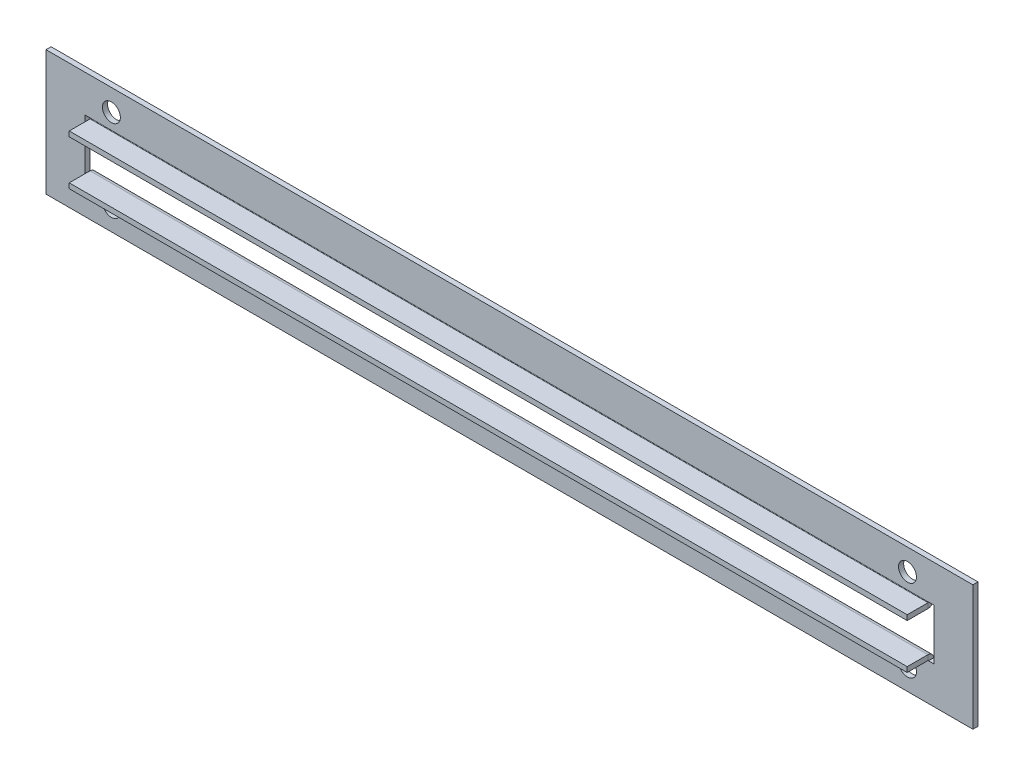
ISO-10303-21;
HEADER;
FILE_DESCRIPTION(('STEP AP214'),'2;1');
FILE_NAME('part.step','',(''),(''),'','','');
FILE_SCHEMA(('AUTOMOTIVE_DESIGN { 1 0 10303 214 1 1 1 1 }'));
ENDSEC;
DATA;
#1=APPLICATION_CONTEXT('core data for automotive mechanical design processes');
#2=APPLICATION_PROTOCOL_DEFINITION('international standard','automotive_design',2000,#1);
#3=PRODUCT_CONTEXT('',#1,'mechanical');
#4=PRODUCT('Part','Part','',(#3));
#5=PRODUCT_RELATED_PRODUCT_CATEGORY('part','',(#4));
#6=PRODUCT_DEFINITION_FORMATION('','',#4);
#7=PRODUCT_DEFINITION_CONTEXT('part definition',#1,'design');
#8=PRODUCT_DEFINITION('design','',#6,#7);
#9=PRODUCT_DEFINITION_SHAPE('','',#8);
#10=(LENGTH_UNIT() NAMED_UNIT(*) SI_UNIT(.MILLI.,.METRE.));
#11=(NAMED_UNIT(*) PLANE_ANGLE_UNIT() SI_UNIT($,.RADIAN.));
#12=(NAMED_UNIT(*) SI_UNIT($,.STERADIAN.) SOLID_ANGLE_UNIT());
#13=UNCERTAINTY_MEASURE_WITH_UNIT(LENGTH_MEASURE(1.E-05),#10,'distance_accuracy_value','');
#14=(GEOMETRIC_REPRESENTATION_CONTEXT(3) GLOBAL_UNCERTAINTY_ASSIGNED_CONTEXT((#13)) GLOBAL_UNIT_ASSIGNED_CONTEXT((#10,
#11,#12)) REPRESENTATION_CONTEXT('',''));
#15=CARTESIAN_POINT('',(0.,0.,0.));
#16=DIRECTION('',(0.,0.,1.));
#17=DIRECTION('',(1.,0.,0.));
#18=AXIS2_PLACEMENT_3D('',#15,#16,#17);
#19=CARTESIAN_POINT('',(0.,0.,2.27838));
#20=DIRECTION('',(0.,0.,-1.));
#21=DIRECTION('',(-1.,0.,0.));
#22=AXIS2_PLACEMENT_3D('',#19,#20,#21);
#23=PLANE('',#22);
#24=CARTESIAN_POINT('',(-177.8,-48.6613547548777,2.27838));
#25=DIRECTION('',(0.,0.,1.));
#26=DIRECTION('',(1.,0.,0.));
#27=AXIS2_PLACEMENT_3D('',#24,#25,#26);
#28=CIRCLE('',#27,4.00050000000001);
#29=CARTESIAN_POINT('',(-173.7995,-48.6613547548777,2.27838));
#30=VERTEX_POINT('',#29);
#31=EDGE_CURVE('E335',#30,#30,#28,.T.);
#32=ORIENTED_EDGE('',*,*,#31,.F.);
#33=EDGE_LOOP('',(#32));
#34=FACE_BOUND('',#33,.T.);
#35=CARTESIAN_POINT('',(177.8,-11.9837547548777,2.27838));
#36=DIRECTION('',(0.,0.,1.));
#37=DIRECTION('',(1.,0.,0.));
#38=AXIS2_PLACEMENT_3D('',#35,#36,#37);
#39=CIRCLE('',#38,4.00050000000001);
#40=CARTESIAN_POINT('',(181.8005,-11.9837547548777,2.27838));
#41=VERTEX_POINT('',#40);
#42=EDGE_CURVE('E328',#41,#41,#39,.T.);
#43=ORIENTED_EDGE('',*,*,#42,.F.);
#44=EDGE_LOOP('',(#43));
#45=FACE_BOUND('',#44,.T.);
#46=CARTESIAN_POINT('',(177.8,-48.6613547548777,2.27838));
#47=DIRECTION('',(0.,0.,1.));
#48=DIRECTION('',(1.,0.,0.));
#49=AXIS2_PLACEMENT_3D('',#46,#47,#48);
#50=CIRCLE('',#49,4.00049999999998);
#51=CARTESIAN_POINT('',(181.8005,-48.6613547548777,2.27838));
#52=VERTEX_POINT('',#51);
#53=EDGE_CURVE('E322',#52,#52,#50,.T.);
#54=ORIENTED_EDGE('',*,*,#53,.F.);
#55=EDGE_LOOP('',(#54));
#56=FACE_BOUND('',#55,.T.);
#57=CARTESIAN_POINT('',(-177.8,-11.9837547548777,2.27838));
#58=DIRECTION('',(0.,0.,1.));
#59=DIRECTION('',(1.,0.,0.));
#60=AXIS2_PLACEMENT_3D('',#57,#58,#59);
#61=CIRCLE('',#60,4.00050000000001);
#62=CARTESIAN_POINT('',(-173.7995,-11.9837547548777,2.27838));
#63=VERTEX_POINT('',#62);
#64=EDGE_CURVE('E334',#63,#63,#61,.T.);
#65=ORIENTED_EDGE('',*,*,#64,.F.);
#66=EDGE_LOOP('',(#65));
#67=FACE_BOUND('',#66,.T.);
#68=DIRECTION('',(0.,-1.,0.));
#69=VECTOR('',#68,1.);
#70=CARTESIAN_POINT('',(-207.01,-58.2625547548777,2.27838));
#71=LINE('',#70,#69);
#72=CARTESIAN_POINT('',(-207.01,-2.38255475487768,2.27838));
#73=VERTEX_POINT('',#72);
#74=CARTESIAN_POINT('',(-207.01,-58.2625547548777,2.27838));
#75=VERTEX_POINT('',#74);
#76=EDGE_CURVE('E349',#73,#75,#71,.T.);
#77=ORIENTED_EDGE('',*,*,#76,.T.);
#78=DIRECTION('',(1.,0.,0.));
#79=VECTOR('',#78,1.);
#80=CARTESIAN_POINT('',(-207.01,-58.2625547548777,2.27838));
#81=LINE('',#80,#79);
#82=CARTESIAN_POINT('',(207.01,-58.2625547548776,2.27838));
#83=VERTEX_POINT('',#82);
#84=EDGE_CURVE('E352',#75,#83,#81,.T.);
#85=ORIENTED_EDGE('',*,*,#84,.T.);
#86=DIRECTION('',(0.,1.,0.));
#87=VECTOR('',#86,1.);
#88=CARTESIAN_POINT('',(207.01,-58.2625547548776,2.27838));
#89=LINE('',#88,#87);
#90=CARTESIAN_POINT('',(207.01,-2.38255475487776,2.27838));
#91=VERTEX_POINT('',#90);
#92=EDGE_CURVE('E355',#83,#91,#89,.T.);
#93=ORIENTED_EDGE('',*,*,#92,.T.);
#94=DIRECTION('',(-1.,0.,0.));
#95=VECTOR('',#94,1.);
#96=CARTESIAN_POINT('',(-207.01,-2.38255475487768,2.27838));
#97=LINE('',#96,#95);
#98=EDGE_CURVE('E357',#91,#73,#97,.T.);
#99=ORIENTED_EDGE('',*,*,#98,.T.);
#100=EDGE_LOOP('',(#77,#85,#93,#99));
#101=FACE_BOUND('',#100,.T.);
#102=DIRECTION('',(1.,0.,0.));
#103=VECTOR('',#102,1.);
#104=CARTESIAN_POINT('',(-189.6872,-41.7017547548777,2.27837999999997));
#105=LINE('',#104,#103);
#106=CARTESIAN_POINT('',(-189.6872,-41.7017547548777,2.27837999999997));
#107=VERTEX_POINT('',#106);
#108=CARTESIAN_POINT('',(-187.1472,-41.7017547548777,2.27837999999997));
#109=VERTEX_POINT('',#108);
#110=EDGE_CURVE('E296',#107,#109,#105,.T.);
#111=ORIENTED_EDGE('',*,*,#110,.F.);
#112=DIRECTION('',(0.,-1.,0.));
#113=VECTOR('',#112,1.);
#114=CARTESIAN_POINT('',(-189.6872,-41.4985547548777,2.27838));
#115=LINE('',#114,#113);
#116=CARTESIAN_POINT('',(-189.6872,-18.9433547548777,2.27838));
#117=VERTEX_POINT('',#116);
#118=EDGE_CURVE('E62',#117,#107,#115,.T.);
#119=ORIENTED_EDGE('',*,*,#118,.F.);
#120=DIRECTION('',(-1.,0.,0.));
#121=VECTOR('',#120,1.);
#122=CARTESIAN_POINT('',(-187.1472,-18.9433547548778,2.27838000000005));
#123=LINE('',#122,#121);
#124=CARTESIAN_POINT('',(-187.1472,-18.9433547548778,2.27838000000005));
#125=VERTEX_POINT('',#124);
#126=EDGE_CURVE('E312',#125,#117,#123,.T.);
#127=ORIENTED_EDGE('',*,*,#126,.F.);
#128=DIRECTION('',(1.,0.,0.));
#129=VECTOR('',#128,1.);
#130=CARTESIAN_POINT('',(187.1472,-18.9433547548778,2.27838000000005));
#131=LINE('',#130,#129);
#132=CARTESIAN_POINT('',(187.1472,-18.9433547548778,2.27838000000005));
#133=VERTEX_POINT('',#132);
#134=EDGE_CURVE('E286',#133,#125,#131,.F.);
#135=ORIENTED_EDGE('',*,*,#134,.F.);
#136=DIRECTION('',(-1.,0.,0.));
#137=VECTOR('',#136,1.);
#138=CARTESIAN_POINT('',(189.6872,-18.9433547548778,2.27838000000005));
#139=LINE('',#138,#137);
#140=CARTESIAN_POINT('',(189.6872,-18.9433547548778,2.27838));
#141=VERTEX_POINT('',#140);
#142=EDGE_CURVE('E308',#141,#133,#139,.T.);
#143=ORIENTED_EDGE('',*,*,#142,.F.);
#144=DIRECTION('',(0.,1.,0.));
#145=VECTOR('',#144,1.);
#146=CARTESIAN_POINT('',(189.6872,-41.4985547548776,2.27838));
#147=LINE('',#146,#145);
#148=CARTESIAN_POINT('',(189.6872,-41.7017547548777,2.27837999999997));
#149=VERTEX_POINT('',#148);
#150=EDGE_CURVE('E54',#149,#141,#147,.T.);
#151=ORIENTED_EDGE('',*,*,#150,.F.);
#152=DIRECTION('',(1.,0.,0.));
#153=VECTOR('',#152,1.);
#154=CARTESIAN_POINT('',(187.1472,-41.7017547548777,2.27837999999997));
#155=LINE('',#154,#153);
#156=CARTESIAN_POINT('',(187.1472,-41.7017547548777,2.27837999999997));
#157=VERTEX_POINT('',#156);
#158=EDGE_CURVE('E301',#157,#149,#155,.T.);
#159=ORIENTED_EDGE('',*,*,#158,.F.);
#160=DIRECTION('',(-1.,0.,0.));
#161=VECTOR('',#160,1.);
#162=CARTESIAN_POINT('',(-187.1472,-41.7017547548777,2.27837999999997));
#163=LINE('',#162,#161);
#164=EDGE_CURVE('E235',#109,#157,#163,.F.);
#165=ORIENTED_EDGE('',*,*,#164,.F.);
#166=EDGE_LOOP('',(#111,#119,#127,#135,#143,#151,#159,#165));
#167=FACE_BOUND('',#166,.T.);
#168=ADVANCED_FACE('F39',(#34,#45,#56,#67,#101,#167),#23,.F.);
#169=CARTESIAN_POINT('',(0.,0.,0.));
#170=DIRECTION('',(0.,0.,-1.));
#171=DIRECTION('',(-1.,0.,0.));
#172=AXIS2_PLACEMENT_3D('',#169,#170,#171);
#173=PLANE('',#172);
#174=CARTESIAN_POINT('',(-177.8,-48.6613547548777,0.));
#175=DIRECTION('',(0.,0.,1.));
#176=DIRECTION('',(1.,0.,0.));
#177=AXIS2_PLACEMENT_3D('',#174,#175,#176);
#178=CIRCLE('',#177,4.00050000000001);
#179=CARTESIAN_POINT('',(-173.7995,-48.6613547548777,0.));
#180=VERTEX_POINT('',#179);
#181=EDGE_CURVE('E331',#180,#180,#178,.T.);
#182=ORIENTED_EDGE('',*,*,#181,.T.);
#183=EDGE_LOOP('',(#182));
#184=FACE_BOUND('',#183,.T.);
#185=CARTESIAN_POINT('',(177.8,-11.9837547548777,0.));
#186=DIRECTION('',(0.,0.,1.));
#187=DIRECTION('',(1.,0.,0.));
#188=AXIS2_PLACEMENT_3D('',#185,#186,#187);
#189=CIRCLE('',#188,4.00050000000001);
#190=CARTESIAN_POINT('',(181.8005,-11.9837547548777,0.));
#191=VERTEX_POINT('',#190);
#192=EDGE_CURVE('E338',#191,#191,#189,.T.);
#193=ORIENTED_EDGE('',*,*,#192,.T.);
#194=EDGE_LOOP('',(#193));
#195=FACE_BOUND('',#194,.T.);
#196=CARTESIAN_POINT('',(177.8,-48.6613547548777,0.));
#197=DIRECTION('',(0.,0.,1.));
#198=DIRECTION('',(1.,0.,0.));
#199=AXIS2_PLACEMENT_3D('',#196,#197,#198);
#200=CIRCLE('',#199,4.00049999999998);
#201=CARTESIAN_POINT('',(181.8005,-48.6613547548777,0.));
#202=VERTEX_POINT('',#201);
#203=EDGE_CURVE('E325',#202,#202,#200,.T.);
#204=ORIENTED_EDGE('',*,*,#203,.T.);
#205=EDGE_LOOP('',(#204));
#206=FACE_BOUND('',#205,.T.);
#207=CARTESIAN_POINT('',(-177.8,-11.9837547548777,0.));
#208=DIRECTION('',(0.,0.,1.));
#209=DIRECTION('',(1.,0.,0.));
#210=AXIS2_PLACEMENT_3D('',#207,#208,#209);
#211=CIRCLE('',#210,4.00050000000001);
#212=CARTESIAN_POINT('',(-173.7995,-11.9837547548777,0.));
#213=VERTEX_POINT('',#212);
#214=EDGE_CURVE('E343',#213,#213,#211,.T.);
#215=ORIENTED_EDGE('',*,*,#214,.T.);
#216=EDGE_LOOP('',(#215));
#217=FACE_BOUND('',#216,.T.);
#218=DIRECTION('',(0.,-1.,0.));
#219=VECTOR('',#218,1.);
#220=CARTESIAN_POINT('',(-207.01,-58.2625547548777,0.));
#221=LINE('',#220,#219);
#222=CARTESIAN_POINT('',(-207.01,-2.38255475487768,0.));
#223=VERTEX_POINT('',#222);
#224=CARTESIAN_POINT('',(-207.01,-58.2625547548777,0.));
#225=VERTEX_POINT('',#224);
#226=EDGE_CURVE('E346',#223,#225,#221,.T.);
#227=ORIENTED_EDGE('',*,*,#226,.F.);
#228=DIRECTION('',(-1.,0.,0.));
#229=VECTOR('',#228,1.);
#230=CARTESIAN_POINT('',(-207.01,-2.38255475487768,0.));
#231=LINE('',#230,#229);
#232=CARTESIAN_POINT('',(207.01,-2.38255475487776,0.));
#233=VERTEX_POINT('',#232);
#234=EDGE_CURVE('E353',#233,#223,#231,.T.);
#235=ORIENTED_EDGE('',*,*,#234,.F.);
#236=DIRECTION('',(0.,1.,0.));
#237=VECTOR('',#236,1.);
#238=CARTESIAN_POINT('',(207.01,-58.2625547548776,0.));
#239=LINE('',#238,#237);
#240=CARTESIAN_POINT('',(207.01,-58.2625547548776,0.));
#241=VERTEX_POINT('',#240);
#242=EDGE_CURVE('E364',#241,#233,#239,.T.);
#243=ORIENTED_EDGE('',*,*,#242,.F.);
#244=DIRECTION('',(1.,0.,0.));
#245=VECTOR('',#244,1.);
#246=CARTESIAN_POINT('',(-207.01,-58.2625547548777,0.));
#247=LINE('',#246,#245);
#248=EDGE_CURVE('E362',#225,#241,#247,.T.);
#249=ORIENTED_EDGE('',*,*,#248,.F.);
#250=EDGE_LOOP('',(#227,#235,#243,#249));
#251=FACE_BOUND('',#250,.T.);
#252=DIRECTION('',(0.,-1.,0.));
#253=VECTOR('',#252,1.);
#254=CARTESIAN_POINT('',(-189.6872,-41.4985547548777,0.));
#255=LINE('',#254,#253);
#256=CARTESIAN_POINT('',(-189.6872,-18.9433547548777,0.));
#257=VERTEX_POINT('',#256);
#258=CARTESIAN_POINT('',(-189.6872,-41.7017547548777,0.));
#259=VERTEX_POINT('',#258);
#260=EDGE_CURVE('E318',#257,#259,#255,.T.);
#261=ORIENTED_EDGE('',*,*,#260,.T.);
#262=DIRECTION('',(1.,0.,0.));
#263=VECTOR('',#262,1.);
#264=CARTESIAN_POINT('',(0.,-41.7017547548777,0.));
#265=LINE('',#264,#263);
#266=CARTESIAN_POINT('',(-187.1472,-41.7017547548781,0.));
#267=VERTEX_POINT('',#266);
#268=EDGE_CURVE('E11',#259,#267,#265,.T.);
#269=ORIENTED_EDGE('',*,*,#268,.T.);
#270=DIRECTION('',(-1.,0.,0.));
#271=VECTOR('',#270,1.);
#272=CARTESIAN_POINT('',(-187.1472,-41.7017547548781,0.));
#273=LINE('',#272,#271);
#274=CARTESIAN_POINT('',(187.1472,-41.7017547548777,0.));
#275=VERTEX_POINT('',#274);
#276=EDGE_CURVE('E184',#267,#275,#273,.F.);
#277=ORIENTED_EDGE('',*,*,#276,.T.);
#278=DIRECTION('',(1.,0.,0.));
#279=VECTOR('',#278,1.);
#280=CARTESIAN_POINT('',(0.,-41.7017547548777,0.));
#281=LINE('',#280,#279);
#282=CARTESIAN_POINT('',(189.6872,-41.7017547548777,0.));
#283=VERTEX_POINT('',#282);
#284=EDGE_CURVE('E47',#275,#283,#281,.T.);
#285=ORIENTED_EDGE('',*,*,#284,.T.);
#286=DIRECTION('',(0.,1.,0.));
#287=VECTOR('',#286,1.);
#288=CARTESIAN_POINT('',(189.6872,-41.4985547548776,0.));
#289=LINE('',#288,#287);
#290=CARTESIAN_POINT('',(189.6872,-18.9433547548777,0.));
#291=VERTEX_POINT('',#290);
#292=EDGE_CURVE('E320',#283,#291,#289,.T.);
#293=ORIENTED_EDGE('',*,*,#292,.T.);
#294=DIRECTION('',(-1.,0.,0.));
#295=VECTOR('',#294,1.);
#296=CARTESIAN_POINT('',(0.,-18.9433547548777,0.));
#297=LINE('',#296,#295);
#298=CARTESIAN_POINT('',(187.1472,-18.9433547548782,0.));
#299=VERTEX_POINT('',#298);
#300=EDGE_CURVE('E381',#291,#299,#297,.T.);
#301=ORIENTED_EDGE('',*,*,#300,.T.);
#302=DIRECTION('',(1.,0.,0.));
#303=VECTOR('',#302,1.);
#304=CARTESIAN_POINT('',(187.1472,-18.9433547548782,0.));
#305=LINE('',#304,#303);
#306=CARTESIAN_POINT('',(-187.1472,-18.9433547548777,0.));
#307=VERTEX_POINT('',#306);
#308=EDGE_CURVE('E273',#299,#307,#305,.F.);
#309=ORIENTED_EDGE('',*,*,#308,.T.);
#310=DIRECTION('',(-1.,0.,0.));
#311=VECTOR('',#310,1.);
#312=CARTESIAN_POINT('',(0.,-18.9433547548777,0.));
#313=LINE('',#312,#311);
#314=EDGE_CURVE('E378',#307,#257,#313,.T.);
#315=ORIENTED_EDGE('',*,*,#314,.T.);
#316=EDGE_LOOP('',(#261,#269,#277,#285,#293,#301,#309,#315));
#317=FACE_BOUND('',#316,.T.);
#318=ADVANCED_FACE('F386',(#184,#195,#206,#217,#251,#317),#173,.T.);
#319=CARTESIAN_POINT('',(-207.01,-58.2625547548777,2.27838));
#320=DIRECTION('',(1.,0.,0.));
#321=DIRECTION('',(0.,0.,-1.));
#322=AXIS2_PLACEMENT_3D('',#319,#320,#321);
#323=PLANE('',#322);
#324=ORIENTED_EDGE('',*,*,#226,.T.);
#325=DIRECTION('',(0.,0.,-1.));
#326=VECTOR('',#325,1.);
#327=CARTESIAN_POINT('',(-207.01,-58.2625547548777,2.27838));
#328=LINE('',#327,#326);
#329=EDGE_CURVE('E375',#75,#225,#328,.T.);
#330=ORIENTED_EDGE('',*,*,#329,.F.);
#331=ORIENTED_EDGE('',*,*,#76,.F.);
#332=DIRECTION('',(0.,0.,-1.));
#333=VECTOR('',#332,1.);
#334=CARTESIAN_POINT('',(-207.01,-2.38255475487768,2.27838));
#335=LINE('',#334,#333);
#336=EDGE_CURVE('E359',#73,#223,#335,.T.);
#337=ORIENTED_EDGE('',*,*,#336,.T.);
#338=EDGE_LOOP('',(#324,#330,#331,#337));
#339=FACE_BOUND('',#338,.T.);
#340=ADVANCED_FACE('F41',(#339),#323,.F.);
#341=CARTESIAN_POINT('',(-207.01,-58.2625547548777,2.27838));
#342=DIRECTION('',(0.,1.,0.));
#343=DIRECTION('',(-1.,0.,0.));
#344=AXIS2_PLACEMENT_3D('',#341,#342,#343);
#345=PLANE('',#344);
#346=ORIENTED_EDGE('',*,*,#248,.T.);
#347=DIRECTION('',(0.,0.,-1.));
#348=VECTOR('',#347,1.);
#349=CARTESIAN_POINT('',(207.01,-58.2625547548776,2.27838));
#350=LINE('',#349,#348);
#351=EDGE_CURVE('E372',#83,#241,#350,.T.);
#352=ORIENTED_EDGE('',*,*,#351,.F.);
#353=ORIENTED_EDGE('',*,*,#84,.F.);
#354=ORIENTED_EDGE('',*,*,#329,.T.);
#355=EDGE_LOOP('',(#346,#352,#353,#354));
#356=FACE_BOUND('',#355,.T.);
#357=ADVANCED_FACE('F453',(#356),#345,.F.);
#358=CARTESIAN_POINT('',(207.01,-58.2625547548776,2.27838));
#359=DIRECTION('',(-1.,0.,0.));
#360=DIRECTION('',(0.,0.,1.));
#361=AXIS2_PLACEMENT_3D('',#358,#359,#360);
#362=PLANE('',#361);
#363=ORIENTED_EDGE('',*,*,#242,.T.);
#364=DIRECTION('',(0.,0.,-1.));
#365=VECTOR('',#364,1.);
#366=CARTESIAN_POINT('',(207.01,-2.38255475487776,2.27838));
#367=LINE('',#366,#365);
#368=EDGE_CURVE('E369',#91,#233,#367,.T.);
#369=ORIENTED_EDGE('',*,*,#368,.F.);
#370=ORIENTED_EDGE('',*,*,#92,.F.);
#371=ORIENTED_EDGE('',*,*,#351,.T.);
#372=EDGE_LOOP('',(#363,#369,#370,#371));
#373=FACE_BOUND('',#372,.T.);
#374=ADVANCED_FACE('F450',(#373),#362,.F.);
#375=CARTESIAN_POINT('',(-207.01,-2.38255475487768,2.27838));
#376=DIRECTION('',(0.,-1.,0.));
#377=DIRECTION('',(1.,0.,0.));
#378=AXIS2_PLACEMENT_3D('',#375,#376,#377);
#379=PLANE('',#378);
#380=ORIENTED_EDGE('',*,*,#234,.T.);
#381=ORIENTED_EDGE('',*,*,#336,.F.);
#382=ORIENTED_EDGE('',*,*,#98,.F.);
#383=ORIENTED_EDGE('',*,*,#368,.T.);
#384=EDGE_LOOP('',(#380,#381,#382,#383));
#385=FACE_BOUND('',#384,.T.);
#386=ADVANCED_FACE('F447',(#385),#379,.F.);
#387=CARTESIAN_POINT('',(-177.8,-11.9837547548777,0.));
#388=DIRECTION('',(0.,0.,1.));
#389=DIRECTION('',(1.,0.,0.));
#390=AXIS2_PLACEMENT_3D('',#387,#388,#389);
#391=CYLINDRICAL_SURFACE('',#390,4.00050000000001);
#392=ORIENTED_EDGE('',*,*,#214,.F.);
#393=EDGE_LOOP('',(#392));
#394=FACE_BOUND('',#393,.T.);
#395=ORIENTED_EDGE('',*,*,#64,.T.);
#396=EDGE_LOOP('',(#395));
#397=FACE_BOUND('',#396,.T.);
#398=ADVANCED_FACE('F444',(#394,#397),#391,.F.);
#399=CARTESIAN_POINT('',(177.8,-48.6613547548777,0.));
#400=DIRECTION('',(0.,0.,1.));
#401=DIRECTION('',(1.,0.,0.));
#402=AXIS2_PLACEMENT_3D('',#399,#400,#401);
#403=CYLINDRICAL_SURFACE('',#402,4.00049999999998);
#404=ORIENTED_EDGE('',*,*,#203,.F.);
#405=EDGE_LOOP('',(#404));
#406=FACE_BOUND('',#405,.T.);
#407=ORIENTED_EDGE('',*,*,#53,.T.);
#408=EDGE_LOOP('',(#407));
#409=FACE_BOUND('',#408,.T.);
#410=ADVANCED_FACE('F529',(#406,#409),#403,.F.);
#411=CARTESIAN_POINT('',(177.8,-11.9837547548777,0.));
#412=DIRECTION('',(0.,0.,1.));
#413=DIRECTION('',(1.,0.,0.));
#414=AXIS2_PLACEMENT_3D('',#411,#412,#413);
#415=CYLINDRICAL_SURFACE('',#414,4.00050000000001);
#416=ORIENTED_EDGE('',*,*,#192,.F.);
#417=EDGE_LOOP('',(#416));
#418=FACE_BOUND('',#417,.T.);
#419=ORIENTED_EDGE('',*,*,#42,.T.);
#420=EDGE_LOOP('',(#419));
#421=FACE_BOUND('',#420,.T.);
#422=ADVANCED_FACE('F532',(#418,#421),#415,.F.);
#423=CARTESIAN_POINT('',(-177.8,-48.6613547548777,0.));
#424=DIRECTION('',(0.,0.,1.));
#425=DIRECTION('',(1.,0.,0.));
#426=AXIS2_PLACEMENT_3D('',#423,#424,#425);
#427=CYLINDRICAL_SURFACE('',#426,4.00050000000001);
#428=ORIENTED_EDGE('',*,*,#181,.F.);
#429=EDGE_LOOP('',(#428));
#430=FACE_BOUND('',#429,.T.);
#431=ORIENTED_EDGE('',*,*,#31,.T.);
#432=EDGE_LOOP('',(#431));
#433=FACE_BOUND('',#432,.T.);
#434=ADVANCED_FACE('F528',(#430,#433),#427,.F.);
#435=CARTESIAN_POINT('',(-189.6872,-41.4985547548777,0.));
#436=DIRECTION('',(-1.,0.,0.));
#437=DIRECTION('',(0.,0.,1.));
#438=AXIS2_PLACEMENT_3D('',#435,#436,#437);
#439=PLANE('',#438);
#440=ORIENTED_EDGE('',*,*,#118,.T.);
#441=DIRECTION('',(0.,0.,-1.));
#442=VECTOR('',#441,1.);
#443=CARTESIAN_POINT('',(-189.6872,-41.7017547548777,2.27837999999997));
#444=LINE('',#443,#442);
#445=EDGE_CURVE('E300',#107,#259,#444,.T.);
#446=ORIENTED_EDGE('',*,*,#445,.T.);
#447=ORIENTED_EDGE('',*,*,#260,.F.);
#448=DIRECTION('',(0.,0.,-1.));
#449=VECTOR('',#448,1.);
#450=CARTESIAN_POINT('',(-189.6872,-18.9433547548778,2.27838000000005));
#451=LINE('',#450,#449);
#452=EDGE_CURVE('E299',#117,#257,#451,.T.);
#453=ORIENTED_EDGE('',*,*,#452,.F.);
#454=EDGE_LOOP('',(#440,#446,#447,#453));
#455=FACE_BOUND('',#454,.T.);
#456=ADVANCED_FACE('F402',(#455),#439,.F.);
#457=CARTESIAN_POINT('',(189.6872,-41.4985547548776,0.));
#458=DIRECTION('',(1.,0.,0.));
#459=DIRECTION('',(0.,0.,-1.));
#460=AXIS2_PLACEMENT_3D('',#457,#458,#459);
#461=PLANE('',#460);
#462=ORIENTED_EDGE('',*,*,#150,.T.);
#463=DIRECTION('',(0.,0.,-1.));
#464=VECTOR('',#463,1.);
#465=CARTESIAN_POINT('',(189.6872,-18.9433547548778,2.27838000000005));
#466=LINE('',#465,#464);
#467=EDGE_CURVE('E311',#141,#291,#466,.T.);
#468=ORIENTED_EDGE('',*,*,#467,.T.);
#469=ORIENTED_EDGE('',*,*,#292,.F.);
#470=DIRECTION('',(0.,0.,-1.));
#471=VECTOR('',#470,1.);
#472=CARTESIAN_POINT('',(189.6872,-41.7017547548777,2.27837999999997));
#473=LINE('',#472,#471);
#474=EDGE_CURVE('E293',#149,#283,#473,.T.);
#475=ORIENTED_EDGE('',*,*,#474,.F.);
#476=EDGE_LOOP('',(#462,#468,#469,#475));
#477=FACE_BOUND('',#476,.T.);
#478=ADVANCED_FACE('F392',(#477),#461,.F.);
#479=CARTESIAN_POINT('',(189.6872,-18.9433547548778,2.27838000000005));
#480=DIRECTION('',(0.,-1.,0.));
#481=DIRECTION('',(0.,0.,-1.));
#482=AXIS2_PLACEMENT_3D('',#479,#480,#481);
#483=PLANE('',#482);
#484=ORIENTED_EDGE('',*,*,#300,.F.);
#485=ORIENTED_EDGE('',*,*,#467,.F.);
#486=ORIENTED_EDGE('',*,*,#142,.T.);
#487=DIRECTION('',(0.,-1.87814549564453E-13,-1.));
#488=VECTOR('',#487,1.);
#489=CARTESIAN_POINT('',(187.1472,-18.9433547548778,2.27838000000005));
#490=LINE('',#489,#488);
#491=EDGE_CURVE('E280',#133,#299,#490,.T.);
#492=ORIENTED_EDGE('',*,*,#491,.T.);
#493=EDGE_LOOP('',(#484,#485,#486,#492));
#494=FACE_BOUND('',#493,.T.);
#495=ADVANCED_FACE('F395',(#494),#483,.T.);
#496=CARTESIAN_POINT('',(-187.1472,-18.9433547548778,2.27838000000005));
#497=DIRECTION('',(0.,-1.,0.));
#498=DIRECTION('',(0.,0.,-1.));
#499=AXIS2_PLACEMENT_3D('',#496,#497,#498);
#500=PLANE('',#499);
#501=ORIENTED_EDGE('',*,*,#314,.F.);
#502=DIRECTION('',(0.,-1.87814549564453E-13,-1.));
#503=VECTOR('',#502,1.);
#504=CARTESIAN_POINT('',(-187.1472,-18.9433547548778,2.27838000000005));
#505=LINE('',#504,#503);
#506=EDGE_CURVE('E290',#125,#307,#505,.T.);
#507=ORIENTED_EDGE('',*,*,#506,.F.);
#508=ORIENTED_EDGE('',*,*,#126,.T.);
#509=ORIENTED_EDGE('',*,*,#452,.T.);
#510=EDGE_LOOP('',(#501,#507,#508,#509));
#511=FACE_BOUND('',#510,.T.);
#512=ADVANCED_FACE('F400',(#511),#500,.T.);
#513=CARTESIAN_POINT('',(-189.6872,-41.7017547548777,2.27837999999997));
#514=DIRECTION('',(0.,1.,0.));
#515=DIRECTION('',(0.,0.,1.));
#516=AXIS2_PLACEMENT_3D('',#513,#514,#515);
#517=PLANE('',#516);
#518=ORIENTED_EDGE('',*,*,#268,.F.);
#519=ORIENTED_EDGE('',*,*,#445,.F.);
#520=ORIENTED_EDGE('',*,*,#110,.T.);
#521=DIRECTION('',(0.,-1.70740499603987E-13,-1.));
#522=VECTOR('',#521,1.);
#523=CARTESIAN_POINT('',(-187.1472,-41.7017547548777,2.27837999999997));
#524=LINE('',#523,#522);
#525=EDGE_CURVE('E231',#109,#267,#524,.T.);
#526=ORIENTED_EDGE('',*,*,#525,.T.);
#527=EDGE_LOOP('',(#518,#519,#520,#526));
#528=FACE_BOUND('',#527,.T.);
#529=ADVANCED_FACE('F406',(#528),#517,.T.);
#530=CARTESIAN_POINT('',(187.1472,-41.7017547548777,2.27837999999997));
#531=DIRECTION('',(0.,1.,0.));
#532=DIRECTION('',(0.,0.,1.));
#533=AXIS2_PLACEMENT_3D('',#530,#531,#532);
#534=PLANE('',#533);
#535=ORIENTED_EDGE('',*,*,#284,.F.);
#536=DIRECTION('',(0.,-1.70740499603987E-13,-1.));
#537=VECTOR('',#536,1.);
#538=CARTESIAN_POINT('',(187.1472,-41.7017547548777,2.27837999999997));
#539=LINE('',#538,#537);
#540=EDGE_CURVE('E238',#157,#275,#539,.T.);
#541=ORIENTED_EDGE('',*,*,#540,.F.);
#542=ORIENTED_EDGE('',*,*,#158,.T.);
#543=ORIENTED_EDGE('',*,*,#474,.T.);
#544=EDGE_LOOP('',(#535,#541,#542,#543));
#545=FACE_BOUND('',#544,.T.);
#546=ADVANCED_FACE('F390',(#545),#534,.T.);
#547=CARTESIAN_POINT('',(-187.1472,-18.9433547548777,2.48158000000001));
#548=DIRECTION('',(-1.,0.,0.));
#549=DIRECTION('',(0.,0.,1.));
#550=AXIS2_PLACEMENT_3D('',#547,#548,#549);
#551=PLANE('',#550);
#552=DIRECTION('',(0.,-1.,0.));
#553=VECTOR('',#552,1.);
#554=CARTESIAN_POINT('',(-187.1472,-19.1465547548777,2.48158));
#555=LINE('',#554,#553);
#556=CARTESIAN_POINT('',(-187.1472,-19.1465547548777,2.48158000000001));
#557=VERTEX_POINT('',#556);
#558=CARTESIAN_POINT('',(-187.1472,-21.4249347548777,2.48158));
#559=VERTEX_POINT('',#558);
#560=EDGE_CURVE('E241',#557,#559,#555,.T.);
#561=ORIENTED_EDGE('',*,*,#560,.F.);
#562=CARTESIAN_POINT('',(-187.1472,-18.9433547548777,2.48158000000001));
#563=DIRECTION('',(1.,0.,0.));
#564=DIRECTION('',(0.,0.,-1.));
#565=AXIS2_PLACEMENT_3D('',#562,#563,#564);
#566=CIRCLE('',#565,0.203199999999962);
#567=EDGE_CURVE('E283',#125,#557,#566,.F.);
#568=ORIENTED_EDGE('',*,*,#567,.F.);
#569=ORIENTED_EDGE('',*,*,#506,.T.);
#570=CARTESIAN_POINT('',(-187.1472,-18.9433547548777,2.48158000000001));
#571=DIRECTION('',(1.,0.,0.));
#572=DIRECTION('',(0.,0.,-1.));
#573=AXIS2_PLACEMENT_3D('',#570,#571,#572);
#574=CIRCLE('',#573,2.48157999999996);
#575=EDGE_CURVE('E276',#307,#559,#574,.F.);
#576=ORIENTED_EDGE('',*,*,#575,.T.);
#577=EDGE_LOOP('',(#561,#568,#569,#576));
#578=FACE_BOUND('',#577,.T.);
#579=ADVANCED_FACE('F480',(#578),#551,.T.);
#580=CARTESIAN_POINT('',(187.1472,-18.9433547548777,2.48158000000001));
#581=DIRECTION('',(-1.,0.,0.));
#582=DIRECTION('',(0.,0.,1.));
#583=AXIS2_PLACEMENT_3D('',#580,#581,#582);
#584=PLANE('',#583);
#585=CARTESIAN_POINT('',(187.1472,-18.9433547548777,2.48158000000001));
#586=DIRECTION('',(1.,0.,0.));
#587=DIRECTION('',(0.,0.,-1.));
#588=AXIS2_PLACEMENT_3D('',#585,#586,#587);
#589=CIRCLE('',#588,0.203199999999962);
#590=CARTESIAN_POINT('',(187.1472,-19.1465547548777,2.48158000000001));
#591=VERTEX_POINT('',#590);
#592=EDGE_CURVE('E272',#591,#133,#589,.T.);
#593=ORIENTED_EDGE('',*,*,#592,.F.);
#594=DIRECTION('',(0.,-1.,0.));
#595=VECTOR('',#594,1.);
#596=CARTESIAN_POINT('',(187.1472,-19.1465547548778,2.48158000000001));
#597=LINE('',#596,#595);
#598=CARTESIAN_POINT('',(187.1472,-21.4249347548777,2.48158000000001));
#599=VERTEX_POINT('',#598);
#600=EDGE_CURVE('E245',#591,#599,#597,.T.);
#601=ORIENTED_EDGE('',*,*,#600,.T.);
#602=CARTESIAN_POINT('',(187.1472,-18.9433547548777,2.48158000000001));
#603=DIRECTION('',(1.,0.,0.));
#604=DIRECTION('',(0.,0.,-1.));
#605=AXIS2_PLACEMENT_3D('',#602,#603,#604);
#606=CIRCLE('',#605,2.48157999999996);
#607=EDGE_CURVE('E277',#599,#299,#606,.T.);
#608=ORIENTED_EDGE('',*,*,#607,.T.);
#609=ORIENTED_EDGE('',*,*,#491,.F.);
#610=EDGE_LOOP('',(#593,#601,#608,#609));
#611=FACE_BOUND('',#610,.T.);
#612=ADVANCED_FACE('F497',(#611),#584,.F.);
#613=CARTESIAN_POINT('',(187.1472,-18.9433547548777,2.48158000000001));
#614=DIRECTION('',(1.,0.,0.));
#615=DIRECTION('',(0.,-1.,0.));
#616=AXIS2_PLACEMENT_3D('',#613,#614,#615);
#617=CYLINDRICAL_SURFACE('',#616,2.48157999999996);
#618=ORIENTED_EDGE('',*,*,#308,.F.);
#619=ORIENTED_EDGE('',*,*,#607,.F.);
#620=DIRECTION('',(-1.,0.,0.));
#621=VECTOR('',#620,1.);
#622=CARTESIAN_POINT('',(0.,-21.4249347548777,2.48158));
#623=LINE('',#622,#621);
#624=EDGE_CURVE('E248',#599,#559,#623,.T.);
#625=ORIENTED_EDGE('',*,*,#624,.T.);
#626=ORIENTED_EDGE('',*,*,#575,.F.);
#627=EDGE_LOOP('',(#618,#619,#625,#626));
#628=FACE_BOUND('',#627,.T.);
#629=ADVANCED_FACE('F507',(#628),#617,.T.);
#630=CARTESIAN_POINT('',(187.1472,-18.9433547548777,2.48158000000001));
#631=DIRECTION('',(1.,0.,0.));
#632=DIRECTION('',(0.,-1.,0.));
#633=AXIS2_PLACEMENT_3D('',#630,#631,#632);
#634=CYLINDRICAL_SURFACE('',#633,0.203199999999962);
#635=ORIENTED_EDGE('',*,*,#134,.T.);
#636=ORIENTED_EDGE('',*,*,#567,.T.);
#637=DIRECTION('',(1.,0.,0.));
#638=VECTOR('',#637,1.);
#639=CARTESIAN_POINT('',(-187.1472,-19.1465547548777,2.48158));
#640=LINE('',#639,#638);
#641=EDGE_CURVE('E243',#557,#591,#640,.T.);
#642=ORIENTED_EDGE('',*,*,#641,.T.);
#643=ORIENTED_EDGE('',*,*,#592,.T.);
#644=EDGE_LOOP('',(#635,#636,#642,#643));
#645=FACE_BOUND('',#644,.T.);
#646=ADVANCED_FACE('F476',(#645),#634,.F.);
#647=CARTESIAN_POINT('',(187.1472,-21.4249347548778,11.7602));
#648=DIRECTION('',(-1.,0.,0.));
#649=DIRECTION('',(0.,-1.,0.));
#650=AXIS2_PLACEMENT_3D('',#647,#648,#649);
#651=PLANE('',#650);
#652=ORIENTED_EDGE('',*,*,#600,.F.);
#653=DIRECTION('',(0.,0.,1.));
#654=VECTOR('',#653,1.);
#655=CARTESIAN_POINT('',(187.1472,-19.1465547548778,11.7602));
#656=LINE('',#655,#654);
#657=CARTESIAN_POINT('',(187.1472,-19.1465547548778,11.7602));
#658=VERTEX_POINT('',#657);
#659=EDGE_CURVE('E252',#591,#658,#656,.T.);
#660=ORIENTED_EDGE('',*,*,#659,.T.);
#661=DIRECTION('',(0.,1.,0.));
#662=VECTOR('',#661,1.);
#663=CARTESIAN_POINT('',(187.1472,-21.4249347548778,11.7602));
#664=LINE('',#663,#662);
#665=CARTESIAN_POINT('',(187.1472,-21.4249347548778,11.7602));
#666=VERTEX_POINT('',#665);
#667=EDGE_CURVE('E269',#666,#658,#664,.T.);
#668=ORIENTED_EDGE('',*,*,#667,.F.);
#669=DIRECTION('',(0.,0.,1.));
#670=VECTOR('',#669,1.);
#671=CARTESIAN_POINT('',(187.1472,-21.4249347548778,11.7602));
#672=LINE('',#671,#670);
#673=EDGE_CURVE('E253',#599,#666,#672,.T.);
#674=ORIENTED_EDGE('',*,*,#673,.F.);
#675=EDGE_LOOP('',(#652,#660,#668,#674));
#676=FACE_BOUND('',#675,.T.);
#677=ADVANCED_FACE('F499',(#676),#651,.F.);
#678=CARTESIAN_POINT('',(-187.1472,-21.4249347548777,2.27837999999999));
#679=DIRECTION('',(1.,0.,0.));
#680=DIRECTION('',(0.,1.,0.));
#681=AXIS2_PLACEMENT_3D('',#678,#679,#680);
#682=PLANE('',#681);
#683=ORIENTED_EDGE('',*,*,#560,.T.);
#684=DIRECTION('',(0.,0.,-1.));
#685=VECTOR('',#684,1.);
#686=CARTESIAN_POINT('',(-187.1472,-21.4249347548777,2.27837999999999));
#687=LINE('',#686,#685);
#688=CARTESIAN_POINT('',(-187.1472,-21.4249347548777,11.7602));
#689=VERTEX_POINT('',#688);
#690=EDGE_CURVE('E258',#689,#559,#687,.T.);
#691=ORIENTED_EDGE('',*,*,#690,.F.);
#692=DIRECTION('',(0.,1.,0.));
#693=VECTOR('',#692,1.);
#694=CARTESIAN_POINT('',(-187.1472,-21.4249347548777,11.7602));
#695=LINE('',#694,#693);
#696=CARTESIAN_POINT('',(-187.1472,-19.1465547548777,11.7602));
#697=VERTEX_POINT('',#696);
#698=EDGE_CURVE('E261',#689,#697,#695,.T.);
#699=ORIENTED_EDGE('',*,*,#698,.T.);
#700=DIRECTION('',(0.,0.,-1.));
#701=VECTOR('',#700,1.);
#702=CARTESIAN_POINT('',(-187.1472,-19.1465547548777,2.27838));
#703=LINE('',#702,#701);
#704=EDGE_CURVE('E256',#697,#557,#703,.T.);
#705=ORIENTED_EDGE('',*,*,#704,.T.);
#706=EDGE_LOOP('',(#683,#691,#699,#705));
#707=FACE_BOUND('',#706,.T.);
#708=ADVANCED_FACE('F483',(#707),#682,.F.);
#709=CARTESIAN_POINT('',(0.,-21.4249347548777,0.));
#710=DIRECTION('',(0.,1.,0.));
#711=DIRECTION('',(0.,0.,1.));
#712=AXIS2_PLACEMENT_3D('',#709,#710,#711);
#713=PLANE('',#712);
#714=ORIENTED_EDGE('',*,*,#624,.F.);
#715=ORIENTED_EDGE('',*,*,#673,.T.);
#716=DIRECTION('',(-1.,0.,0.));
#717=VECTOR('',#716,1.);
#718=CARTESIAN_POINT('',(-187.1472,-21.4249347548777,11.7602));
#719=LINE('',#718,#717);
#720=EDGE_CURVE('E255',#666,#689,#719,.T.);
#721=ORIENTED_EDGE('',*,*,#720,.T.);
#722=ORIENTED_EDGE('',*,*,#690,.T.);
#723=EDGE_LOOP('',(#714,#715,#721,#722));
#724=FACE_BOUND('',#723,.T.);
#725=ADVANCED_FACE('F487',(#724),#713,.F.);
#726=CARTESIAN_POINT('',(0.,-19.1465547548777,0.));
#727=DIRECTION('',(0.,1.,0.));
#728=DIRECTION('',(0.,0.,1.));
#729=AXIS2_PLACEMENT_3D('',#726,#727,#728);
#730=PLANE('',#729);
#731=ORIENTED_EDGE('',*,*,#659,.F.);
#732=ORIENTED_EDGE('',*,*,#641,.F.);
#733=ORIENTED_EDGE('',*,*,#704,.F.);
#734=DIRECTION('',(-1.,0.,0.));
#735=VECTOR('',#734,1.);
#736=CARTESIAN_POINT('',(-187.1472,-19.1465547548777,11.7602));
#737=LINE('',#736,#735);
#738=EDGE_CURVE('E263',#658,#697,#737,.T.);
#739=ORIENTED_EDGE('',*,*,#738,.F.);
#740=EDGE_LOOP('',(#731,#732,#733,#739));
#741=FACE_BOUND('',#740,.T.);
#742=ADVANCED_FACE('F429',(#741),#730,.T.);
#743=CARTESIAN_POINT('',(-187.1472,-21.4249347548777,11.7602));
#744=DIRECTION('',(0.,0.,-1.));
#745=DIRECTION('',(0.,1.,0.));
#746=AXIS2_PLACEMENT_3D('',#743,#744,#745);
#747=PLANE('',#746);
#748=ORIENTED_EDGE('',*,*,#738,.T.);
#749=ORIENTED_EDGE('',*,*,#698,.F.);
#750=ORIENTED_EDGE('',*,*,#720,.F.);
#751=ORIENTED_EDGE('',*,*,#667,.T.);
#752=EDGE_LOOP('',(#748,#749,#750,#751));
#753=FACE_BOUND('',#752,.T.);
#754=ADVANCED_FACE('F422',(#753),#747,.F.);
#755=CARTESIAN_POINT('',(187.1472,-41.7017547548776,2.48158000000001));
#756=DIRECTION('',(1.,0.,0.));
#757=DIRECTION('',(0.,0.,-1.));
#758=AXIS2_PLACEMENT_3D('',#755,#756,#757);
#759=PLANE('',#758);
#760=DIRECTION('',(0.,1.,0.));
#761=VECTOR('',#760,1.);
#762=CARTESIAN_POINT('',(187.1472,-41.4985547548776,2.48158));
#763=LINE('',#762,#761);
#764=CARTESIAN_POINT('',(187.1472,-41.4985547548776,2.48158));
#765=VERTEX_POINT('',#764);
#766=CARTESIAN_POINT('',(187.1472,-39.2201747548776,2.48157999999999));
#767=VERTEX_POINT('',#766);
#768=EDGE_CURVE('E414',#765,#767,#763,.T.);
#769=ORIENTED_EDGE('',*,*,#768,.F.);
#770=CARTESIAN_POINT('',(187.1472,-41.7017547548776,2.48158000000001));
#771=DIRECTION('',(-1.,0.,0.));
#772=DIRECTION('',(0.,0.,1.));
#773=AXIS2_PLACEMENT_3D('',#770,#771,#772);
#774=CIRCLE('',#773,0.203200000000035);
#775=EDGE_CURVE('E187',#157,#765,#774,.F.);
#776=ORIENTED_EDGE('',*,*,#775,.F.);
#777=ORIENTED_EDGE('',*,*,#540,.T.);
#778=CARTESIAN_POINT('',(187.1472,-41.7017547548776,2.48158000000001));
#779=DIRECTION('',(-1.,0.,0.));
#780=DIRECTION('',(0.,0.,1.));
#781=AXIS2_PLACEMENT_3D('',#778,#779,#780);
#782=CIRCLE('',#781,2.48158000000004);
#783=EDGE_CURVE('E230',#275,#767,#782,.F.);
#784=ORIENTED_EDGE('',*,*,#783,.T.);
#785=EDGE_LOOP('',(#769,#776,#777,#784));
#786=FACE_BOUND('',#785,.T.);
#787=ADVANCED_FACE('F420',(#786),#759,.T.);
#788=CARTESIAN_POINT('',(-187.1472,-41.7017547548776,2.48158000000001));
#789=DIRECTION('',(1.,0.,0.));
#790=DIRECTION('',(0.,0.,-1.));
#791=AXIS2_PLACEMENT_3D('',#788,#789,#790);
#792=PLANE('',#791);
#793=CARTESIAN_POINT('',(-187.1472,-41.7017547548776,2.48158000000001));
#794=DIRECTION('',(-1.,0.,0.));
#795=DIRECTION('',(0.,0.,1.));
#796=AXIS2_PLACEMENT_3D('',#793,#794,#795);
#797=CIRCLE('',#796,0.203200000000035);
#798=CARTESIAN_POINT('',(-187.1472,-41.4985547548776,2.48158));
#799=VERTEX_POINT('',#798);
#800=EDGE_CURVE('E194',#799,#109,#797,.T.);
#801=ORIENTED_EDGE('',*,*,#800,.F.);
#802=DIRECTION('',(0.,1.,0.));
#803=VECTOR('',#802,1.);
#804=CARTESIAN_POINT('',(-187.1472,-41.4985547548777,2.48158000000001));
#805=LINE('',#804,#803);
#806=CARTESIAN_POINT('',(-187.1472,-39.2201747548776,2.48158));
#807=VERTEX_POINT('',#806);
#808=EDGE_CURVE('E191',#799,#807,#805,.T.);
#809=ORIENTED_EDGE('',*,*,#808,.T.);
#810=CARTESIAN_POINT('',(-187.1472,-41.7017547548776,2.48158000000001));
#811=DIRECTION('',(-1.,0.,0.));
#812=DIRECTION('',(0.,0.,1.));
#813=AXIS2_PLACEMENT_3D('',#810,#811,#812);
#814=CIRCLE('',#813,2.48158000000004);
#815=EDGE_CURVE('E177',#807,#267,#814,.T.);
#816=ORIENTED_EDGE('',*,*,#815,.T.);
#817=ORIENTED_EDGE('',*,*,#525,.F.);
#818=EDGE_LOOP('',(#801,#809,#816,#817));
#819=FACE_BOUND('',#818,.T.);
#820=ADVANCED_FACE('F192',(#819),#792,.F.);
#821=CARTESIAN_POINT('',(-187.1472,-41.7017547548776,2.48158000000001));
#822=DIRECTION('',(-1.,0.,0.));
#823=DIRECTION('',(0.,1.,0.));
#824=AXIS2_PLACEMENT_3D('',#821,#822,#823);
#825=CYLINDRICAL_SURFACE('',#824,2.48158000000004);
#826=ORIENTED_EDGE('',*,*,#276,.F.);
#827=ORIENTED_EDGE('',*,*,#815,.F.);
#828=DIRECTION('',(1.,0.,0.));
#829=VECTOR('',#828,1.);
#830=CARTESIAN_POINT('',(0.,-39.2201747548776,2.48158));
#831=LINE('',#830,#829);
#832=EDGE_CURVE('E181',#807,#767,#831,.T.);
#833=ORIENTED_EDGE('',*,*,#832,.T.);
#834=ORIENTED_EDGE('',*,*,#783,.F.);
#835=EDGE_LOOP('',(#826,#827,#833,#834));
#836=FACE_BOUND('',#835,.T.);
#837=ADVANCED_FACE('F179',(#836),#825,.T.);
#838=CARTESIAN_POINT('',(-187.1472,-41.7017547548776,2.48158000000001));
#839=DIRECTION('',(-1.,0.,0.));
#840=DIRECTION('',(0.,1.,0.));
#841=AXIS2_PLACEMENT_3D('',#838,#839,#840);
#842=CYLINDRICAL_SURFACE('',#841,0.203200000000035);
#843=ORIENTED_EDGE('',*,*,#164,.T.);
#844=ORIENTED_EDGE('',*,*,#775,.T.);
#845=DIRECTION('',(-1.,0.,0.));
#846=VECTOR('',#845,1.);
#847=CARTESIAN_POINT('',(187.1472,-41.4985547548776,2.48158));
#848=LINE('',#847,#846);
#849=EDGE_CURVE('E198',#765,#799,#848,.T.);
#850=ORIENTED_EDGE('',*,*,#849,.T.);
#851=ORIENTED_EDGE('',*,*,#800,.T.);
#852=EDGE_LOOP('',(#843,#844,#850,#851));
#853=FACE_BOUND('',#852,.T.);
#854=ADVANCED_FACE('F409',(#853),#842,.F.);
#855=CARTESIAN_POINT('',(-187.1472,-39.2201747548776,11.7602));
#856=DIRECTION('',(1.,0.,0.));
#857=DIRECTION('',(0.,1.,0.));
#858=AXIS2_PLACEMENT_3D('',#855,#856,#857);
#859=PLANE('',#858);
#860=ORIENTED_EDGE('',*,*,#808,.F.);
#861=DIRECTION('',(0.,0.,1.));
#862=VECTOR('',#861,1.);
#863=CARTESIAN_POINT('',(-187.1472,-41.4985547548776,11.7602));
#864=LINE('',#863,#862);
#865=CARTESIAN_POINT('',(-187.1472,-41.4985547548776,11.7602));
#866=VERTEX_POINT('',#865);
#867=EDGE_CURVE('E207',#799,#866,#864,.T.);
#868=ORIENTED_EDGE('',*,*,#867,.T.);
#869=DIRECTION('',(0.,-1.,0.));
#870=VECTOR('',#869,1.);
#871=CARTESIAN_POINT('',(-187.1472,-39.2201747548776,11.7602));
#872=LINE('',#871,#870);
#873=CARTESIAN_POINT('',(-187.1472,-39.2201747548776,11.7602));
#874=VERTEX_POINT('',#873);
#875=EDGE_CURVE('E212',#874,#866,#872,.T.);
#876=ORIENTED_EDGE('',*,*,#875,.F.);
#877=DIRECTION('',(0.,0.,1.));
#878=VECTOR('',#877,1.);
#879=CARTESIAN_POINT('',(-187.1472,-39.2201747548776,11.7602));
#880=LINE('',#879,#878);
#881=EDGE_CURVE('E203',#807,#874,#880,.T.);
#882=ORIENTED_EDGE('',*,*,#881,.F.);
#883=EDGE_LOOP('',(#860,#868,#876,#882));
#884=FACE_BOUND('',#883,.T.);
#885=ADVANCED_FACE('F210',(#884),#859,.F.);
#886=CARTESIAN_POINT('',(187.1472,-39.2201747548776,2.27837999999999));
#887=DIRECTION('',(-1.,0.,0.));
#888=DIRECTION('',(0.,-1.,0.));
#889=AXIS2_PLACEMENT_3D('',#886,#887,#888);
#890=PLANE('',#889);
#891=ORIENTED_EDGE('',*,*,#768,.T.);
#892=DIRECTION('',(0.,0.,-1.));
#893=VECTOR('',#892,1.);
#894=CARTESIAN_POINT('',(187.1472,-39.2201747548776,2.27837999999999));
#895=LINE('',#894,#893);
#896=CARTESIAN_POINT('',(187.1472,-39.2201747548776,11.7602));
#897=VERTEX_POINT('',#896);
#898=EDGE_CURVE('E206',#897,#767,#895,.T.);
#899=ORIENTED_EDGE('',*,*,#898,.F.);
#900=DIRECTION('',(0.,-1.,0.));
#901=VECTOR('',#900,1.);
#902=CARTESIAN_POINT('',(187.1472,-39.2201747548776,11.7602));
#903=LINE('',#902,#901);
#904=CARTESIAN_POINT('',(187.1472,-41.4985547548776,11.7602));
#905=VERTEX_POINT('',#904);
#906=EDGE_CURVE('E223',#897,#905,#903,.T.);
#907=ORIENTED_EDGE('',*,*,#906,.T.);
#908=DIRECTION('',(0.,0.,-1.));
#909=VECTOR('',#908,1.);
#910=CARTESIAN_POINT('',(187.1472,-41.4985547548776,2.27838));
#911=LINE('',#910,#909);
#912=EDGE_CURVE('E214',#905,#765,#911,.T.);
#913=ORIENTED_EDGE('',*,*,#912,.T.);
#914=EDGE_LOOP('',(#891,#899,#907,#913));
#915=FACE_BOUND('',#914,.T.);
#916=ADVANCED_FACE('F418',(#915),#890,.F.);
#917=CARTESIAN_POINT('',(0.,-39.2201747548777,1.43890435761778E-13));
#918=DIRECTION('',(0.,-1.,0.));
#919=DIRECTION('',(0.,0.,-1.));
#920=AXIS2_PLACEMENT_3D('',#917,#918,#919);
#921=PLANE('',#920);
#922=ORIENTED_EDGE('',*,*,#832,.F.);
#923=ORIENTED_EDGE('',*,*,#881,.T.);
#924=DIRECTION('',(1.,0.,0.));
#925=VECTOR('',#924,1.);
#926=CARTESIAN_POINT('',(187.1472,-39.2201747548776,11.7602));
#927=LINE('',#926,#925);
#928=EDGE_CURVE('E213',#874,#897,#927,.T.);
#929=ORIENTED_EDGE('',*,*,#928,.T.);
#930=ORIENTED_EDGE('',*,*,#898,.T.);
#931=EDGE_LOOP('',(#922,#923,#929,#930));
#932=FACE_BOUND('',#931,.T.);
#933=ADVANCED_FACE('F202',(#932),#921,.F.);
#934=CARTESIAN_POINT('',(0.,-41.4985547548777,1.51845357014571E-13));
#935=DIRECTION('',(0.,-1.,0.));
#936=DIRECTION('',(0.,0.,-1.));
#937=AXIS2_PLACEMENT_3D('',#934,#935,#936);
#938=PLANE('',#937);
#939=ORIENTED_EDGE('',*,*,#867,.F.);
#940=ORIENTED_EDGE('',*,*,#849,.F.);
#941=ORIENTED_EDGE('',*,*,#912,.F.);
#942=DIRECTION('',(1.,0.,0.));
#943=VECTOR('',#942,1.);
#944=CARTESIAN_POINT('',(187.1472,-41.4985547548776,11.7602));
#945=LINE('',#944,#943);
#946=EDGE_CURVE('E218',#866,#905,#945,.T.);
#947=ORIENTED_EDGE('',*,*,#946,.F.);
#948=EDGE_LOOP('',(#939,#940,#941,#947));
#949=FACE_BOUND('',#948,.T.);
#950=ADVANCED_FACE('F750',(#949),#938,.T.);
#951=CARTESIAN_POINT('',(187.1472,-39.2201747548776,11.7602));
#952=DIRECTION('',(0.,0.,-1.));
#953=DIRECTION('',(0.,1.,0.));
#954=AXIS2_PLACEMENT_3D('',#951,#952,#953);
#955=PLANE('',#954);
#956=ORIENTED_EDGE('',*,*,#946,.T.);
#957=ORIENTED_EDGE('',*,*,#906,.F.);
#958=ORIENTED_EDGE('',*,*,#928,.F.);
#959=ORIENTED_EDGE('',*,*,#875,.T.);
#960=EDGE_LOOP('',(#956,#957,#958,#959));
#961=FACE_BOUND('',#960,.T.);
#962=ADVANCED_FACE('F760',(#961),#955,.F.);
#963=CLOSED_SHELL('',(#168,#318,#340,#357,#374,#386,#398,#410,#422,#434,#456,#478,#495,#512,
#529,#546,#579,#612,#629,#646,#677,#708,#725,#742,#754,#787,#820,#837,#854,#885,#916,#933,#950,#962));
#964=MANIFOLD_SOLID_BREP('B2',#963);
#965=ADVANCED_BREP_SHAPE_REPRESENTATION('',(#18,#964),#14);
#966=SHAPE_DEFINITION_REPRESENTATION(#9,#965);
ENDSEC;
END-ISO-10303-21;
